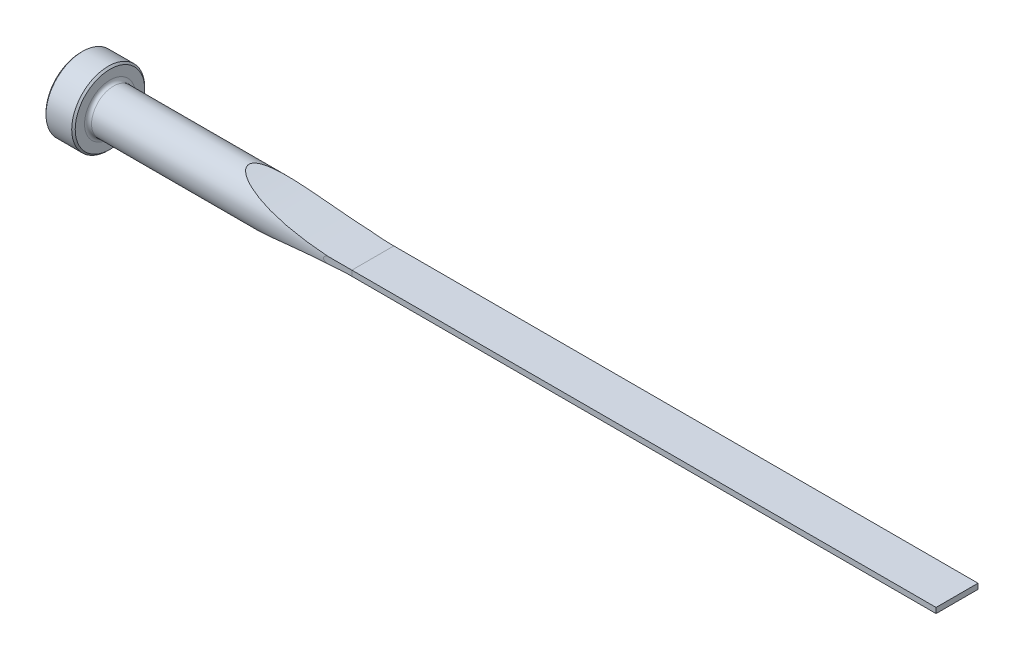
ISO-10303-21;
HEADER;
FILE_DESCRIPTION(('STEP AP214'),'2;1');
FILE_NAME('part.step','',(''),(''),'','','');
FILE_SCHEMA(('AUTOMOTIVE_DESIGN { 1 0 10303 214 1 1 1 1 }'));
ENDSEC;
DATA;
#1=APPLICATION_CONTEXT('core data for automotive mechanical design processes');
#2=APPLICATION_PROTOCOL_DEFINITION('international standard','automotive_design',2000,#1);
#3=PRODUCT_CONTEXT('',#1,'mechanical');
#4=PRODUCT('Part','Part','',(#3));
#5=PRODUCT_RELATED_PRODUCT_CATEGORY('part','',(#4));
#6=PRODUCT_DEFINITION_FORMATION('','',#4);
#7=PRODUCT_DEFINITION_CONTEXT('part definition',#1,'design');
#8=PRODUCT_DEFINITION('design','',#6,#7);
#9=PRODUCT_DEFINITION_SHAPE('','',#8);
#10=(LENGTH_UNIT() NAMED_UNIT(*) SI_UNIT(.MILLI.,.METRE.));
#11=(NAMED_UNIT(*) PLANE_ANGLE_UNIT() SI_UNIT($,.RADIAN.));
#12=(NAMED_UNIT(*) SI_UNIT($,.STERADIAN.) SOLID_ANGLE_UNIT());
#13=UNCERTAINTY_MEASURE_WITH_UNIT(LENGTH_MEASURE(1.E-05),#10,'distance_accuracy_value','');
#14=(GEOMETRIC_REPRESENTATION_CONTEXT(3) GLOBAL_UNCERTAINTY_ASSIGNED_CONTEXT((#13)) GLOBAL_UNIT_ASSIGNED_CONTEXT((#10,
#11,#12)) REPRESENTATION_CONTEXT('',''));
#15=CARTESIAN_POINT('',(0.,0.,0.));
#16=DIRECTION('',(0.,0.,1.));
#17=DIRECTION('',(1.,0.,0.));
#18=AXIS2_PLACEMENT_3D('',#15,#16,#17);
#19=CARTESIAN_POINT('',(0.,0.,0.));
#20=DIRECTION('',(-1.,0.,0.));
#21=DIRECTION('',(0.,0.,1.));
#22=AXIS2_PLACEMENT_3D('',#19,#20,#21);
#23=CYLINDRICAL_SURFACE('',#22,4.7625);
#24=CARTESIAN_POINT('',(7.112,0.,0.));
#25=DIRECTION('',(-1.,0.,0.));
#26=DIRECTION('',(0.,0.,1.));
#27=AXIS2_PLACEMENT_3D('',#24,#25,#26);
#28=CIRCLE('',#27,4.7625);
#29=CARTESIAN_POINT('',(7.112,0.,4.7625));
#30=VERTEX_POINT('',#29);
#31=EDGE_CURVE('E153',#30,#30,#28,.F.);
#32=ORIENTED_EDGE('',*,*,#31,.T.);
#33=EDGE_LOOP('',(#32));
#34=FACE_BOUND('',#33,.T.);
#35=CARTESIAN_POINT('',(63.5,1.37629566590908,4.55929999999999));
#36=CARTESIAN_POINT('',(63.300243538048,1.37627017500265,4.55929946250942));
#37=CARTESIAN_POINT('',(63.1004832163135,1.37406392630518,4.55997325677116));
#38=CARTESIAN_POINT('',(62.7010249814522,1.36511039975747,4.56266611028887));
#39=CARTESIAN_POINT('',(62.5013270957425,1.35836200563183,4.56468550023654));
#40=CARTESIAN_POINT('',(62.1003478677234,1.34006170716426,4.57009060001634));
#41=CARTESIAN_POINT('',(61.8990686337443,1.32846669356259,4.57348856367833));
#42=CARTESIAN_POINT('',(61.4969284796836,1.30007175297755,4.58164172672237));
#43=CARTESIAN_POINT('',(61.296067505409,1.28327254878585,4.58639673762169));
#44=CARTESIAN_POINT('',(60.8961767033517,1.2439534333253,4.59721659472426));
#45=CARTESIAN_POINT('',(60.6971431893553,1.22146913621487,4.6032732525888));
#46=CARTESIAN_POINT('',(60.2999040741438,1.16973426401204,4.61669265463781));
#47=CARTESIAN_POINT('',(60.1016988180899,1.14048110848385,4.62405589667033));
#48=CARTESIAN_POINT('',(59.7074850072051,1.07370926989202,4.64001372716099));
#49=CARTESIAN_POINT('',(59.5114710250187,1.03622172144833,4.64860363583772));
#50=CARTESIAN_POINT('',(59.1219644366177,0.950234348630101,4.66695416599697));
#51=CARTESIAN_POINT('',(58.9284697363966,0.901744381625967,4.67671373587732));
#52=CARTESIAN_POINT('',(58.689568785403,0.830609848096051,4.68952997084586));
#53=CARTESIAN_POINT('',(58.6417966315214,0.815810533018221,4.69213189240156));
#54=CARTESIAN_POINT('',(58.5466454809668,0.784967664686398,4.69739068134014));
#55=CARTESIAN_POINT('',(58.4992665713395,0.768923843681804,4.70004756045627));
#56=CARTESIAN_POINT('',(58.3571752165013,0.718404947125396,4.70812874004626));
#57=CARTESIAN_POINT('',(58.263234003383,0.681752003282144,4.71362458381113));
#58=CARTESIAN_POINT('',(58.0775344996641,0.599731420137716,4.72477713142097));
#59=CARTESIAN_POINT('',(57.9858203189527,0.554256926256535,4.73043499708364));
#60=CARTESIAN_POINT('',(57.8546141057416,0.476034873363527,4.73871868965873));
#61=CARTESIAN_POINT('',(57.8120990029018,0.448424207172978,4.7414354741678));
#62=CARTESIAN_POINT('',(57.7304247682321,0.388667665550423,4.74670987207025));
#63=CARTESIAN_POINT('',(57.6912549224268,0.356537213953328,4.74926798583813));
#64=CARTESIAN_POINT('',(57.6343845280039,0.30109449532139,4.75301502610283));
#65=CARTESIAN_POINT('',(57.6146643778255,0.279884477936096,4.75432176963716));
#66=CARTESIAN_POINT('',(57.578171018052,0.235020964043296,4.75675058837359));
#67=CARTESIAN_POINT('',(57.5613938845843,0.211370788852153,4.75787290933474));
#68=CARTESIAN_POINT('',(57.5361358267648,0.168085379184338,4.75956809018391));
#69=CARTESIAN_POINT('',(57.526635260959,0.149056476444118,4.76020769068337));
#70=CARTESIAN_POINT('',(57.51078402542,0.10971358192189,4.76127659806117));
#71=CARTESIAN_POINT('',(57.5044294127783,0.089401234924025,4.76170616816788));
#72=CARTESIAN_POINT('',(57.4955459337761,0.0476995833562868,4.76230708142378));
#73=CARTESIAN_POINT('',(57.4930580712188,0.0263011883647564,4.76247565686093));
#74=CARTESIAN_POINT('',(57.4924127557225,-0.0165581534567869,4.76251936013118));
#75=CARTESIAN_POINT('',(57.4942536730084,-0.0380190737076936,4.76239459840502));
#76=CARTESIAN_POINT('',(57.5014223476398,-0.0771509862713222,4.76190953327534));
#77=CARTESIAN_POINT('',(57.5062147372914,-0.0949256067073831,4.76158540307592));
#78=CARTESIAN_POINT('',(57.5183183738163,-0.129583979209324,4.76076832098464));
#79=CARTESIAN_POINT('',(57.5256312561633,-0.146467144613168,4.76027525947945));
#80=CARTESIAN_POINT('',(57.5478239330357,-0.190109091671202,4.75878258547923));
#81=CARTESIAN_POINT('',(57.564497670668,-0.215945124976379,4.75766444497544));
#82=CARTESIAN_POINT('',(57.6015159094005,-0.264813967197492,4.75519504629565));
#83=CARTESIAN_POINT('',(57.6218718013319,-0.28783769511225,4.75384306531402));
#84=CARTESIAN_POINT('',(57.6862463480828,-0.353109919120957,4.74959319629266));
#85=CARTESIAN_POINT('',(57.7337556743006,-0.391849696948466,4.74648889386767));
#86=CARTESIAN_POINT('',(57.8332528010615,-0.462955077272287,4.74007706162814));
#87=CARTESIAN_POINT('',(57.8852557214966,-0.495297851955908,4.73676885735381));
#88=CARTESIAN_POINT('',(58.0324605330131,-0.578484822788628,4.72754240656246));
#89=CARTESIAN_POINT('',(58.1303120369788,-0.624585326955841,4.72156110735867));
#90=CARTESIAN_POINT('',(58.3296567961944,-0.708279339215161,4.70972175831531));
#91=CARTESIAN_POINT('',(58.431158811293,-0.745850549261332,4.70386406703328));
#92=CARTESIAN_POINT('',(58.637175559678,-0.815246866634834,4.69233729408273));
#93=CARTESIAN_POINT('',(58.7417096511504,-0.84701459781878,4.68667050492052));
#94=CARTESIAN_POINT('',(58.9519315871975,-0.905852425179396,4.67565197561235));
#95=CARTESIAN_POINT('',(59.0576177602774,-0.932928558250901,4.67029983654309));
#96=CARTESIAN_POINT('',(59.3472077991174,-1.00180171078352,4.65615804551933));
#97=CARTESIAN_POINT('',(59.5319939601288,-1.03994988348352,4.64770520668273));
#98=CARTESIAN_POINT('',(59.9031150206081,-1.10820041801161,4.63190013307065));
#99=CARTESIAN_POINT('',(60.0894504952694,-1.13829964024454,4.62454832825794));
#100=CARTESIAN_POINT('',(60.4634968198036,-1.19209136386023,4.61097562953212));
#101=CARTESIAN_POINT('',(60.6512097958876,-1.21576959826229,4.60475726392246));
#102=CARTESIAN_POINT('',(61.0272867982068,-1.25764094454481,4.59349611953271));
#103=CARTESIAN_POINT('',(61.2156508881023,-1.2758335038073,4.58845345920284));
#104=CARTESIAN_POINT('',(61.7534776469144,-1.32086317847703,4.57577149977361));
#105=CARTESIAN_POINT('',(62.1034775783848,-1.34186157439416,4.56957976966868));
#106=CARTESIAN_POINT('',(62.628033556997,-1.36263417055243,4.56340533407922));
#107=CARTESIAN_POINT('',(62.8023917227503,-1.36777128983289,4.56186604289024));
#108=CARTESIAN_POINT('',(63.151163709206,-1.37459791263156,4.55981341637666));
#109=CARTESIAN_POINT('',(63.3255775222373,-1.37628777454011,4.55929997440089));
#110=CARTESIAN_POINT('',(63.4999999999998,-1.37629566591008,4.55929999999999));
#111=B_SPLINE_CURVE_WITH_KNOTS('',3,(#35,#36,#37,#38,#39,#40,#41,#42,#43,#44,#45,#46,#47,#48,
#49,#50,#51,#52,#53,#54,#55,#56,#57,#58,#59,#60,#61,#62,#63,#64,#65,#66,#67,#68,#69,#70,#71,#72,
#73,#74,#75,#76,#77,#78,#79,#80,#81,#82,#83,#84,#85,#86,#87,#88,#89,#90,#91,#92,#93,#94,#95,#96,
#97,#98,#99,#100,#101,#102,#103,#104,#105,#106,#107,#108,#109,#110),.UNSPECIFIED.,.F.,.F.,(4,2,
2,2,2,2,2,2,2,2,2,2,2,2,2,2,2,2,2,2,2,2,2,2,2,2,2,2,2,2,2,2,2,2,2,2,2,4),(0.,0.599262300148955,
1.19867192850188,1.80353056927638,2.40830524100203,3.00938132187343,3.6106869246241,
4.20975694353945,4.80829234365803,4.95851786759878,5.10877580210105,5.41155733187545,
5.71826557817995,5.87039269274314,6.0220127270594,6.10881533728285,6.19550132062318,
6.25911958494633,6.32265791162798,6.38686552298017,6.45104896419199,6.50606849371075,
6.56112379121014,6.65289509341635,6.74495530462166,6.92807013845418,7.11182707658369,
7.43597686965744,7.76096456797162,8.08900931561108,8.41662876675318,8.98296372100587,
9.54951926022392,10.1173235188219,10.6851849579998,11.7368092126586,12.2601040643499,
12.7833445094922),.UNSPECIFIED.);
#112=CARTESIAN_POINT('',(58.3937223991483,0.730969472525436,4.70606947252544));
#113=VERTEX_POINT('',#112);
#114=CARTESIAN_POINT('',(58.393722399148,-0.730969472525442,4.70606947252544));
#115=VERTEX_POINT('',#114);
#116=EDGE_CURVE('E156',#113,#115,#111,.T.);
#117=ORIENTED_EDGE('',*,*,#116,.F.);
#118=CARTESIAN_POINT('',(63.5,0.584199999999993,4.72653325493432));
#119=CARTESIAN_POINT('',(63.1029447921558,0.584199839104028,4.72652364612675));
#120=CARTESIAN_POINT('',(62.7058898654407,0.586860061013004,4.7262042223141));
#121=CARTESIAN_POINT('',(61.9118518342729,0.597500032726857,4.72487593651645));
#122=CARTESIAN_POINT('',(61.5148687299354,0.605479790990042,4.7238670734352));
#123=CARTESIAN_POINT('',(60.7210149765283,0.626758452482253,4.72108998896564));
#124=CARTESIAN_POINT('',(60.3241443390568,0.640057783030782,4.71932170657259));
#125=CARTESIAN_POINT('',(59.5306250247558,0.671972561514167,4.71488209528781));
#126=CARTESIAN_POINT('',(59.1339763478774,0.690588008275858,4.71221076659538));
#127=CARTESIAN_POINT('',(57.942109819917,0.754530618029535,4.70255315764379));
#128=CARTESIAN_POINT('',(57.1473181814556,0.807891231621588,4.69392942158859));
#129=CARTESIAN_POINT('',(55.5596004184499,0.935939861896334,4.67008030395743));
#130=CARTESIAN_POINT('',(54.7666742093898,1.01062689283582,4.65485522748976));
#131=CARTESIAN_POINT('',(53.1830270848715,1.1812867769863,4.61451041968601));
#132=CARTESIAN_POINT('',(52.3923071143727,1.27726765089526,4.58938695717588));
#133=CARTESIAN_POINT('',(51.2087661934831,1.4370868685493,4.5408421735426));
#134=CARTESIAN_POINT('',(50.814638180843,1.49300736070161,4.52284840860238));
#135=CARTESIAN_POINT('',(50.0273899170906,1.61010184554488,4.48250212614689));
#136=CARTESIAN_POINT('',(49.6342696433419,1.67127571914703,4.46014970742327));
#137=CARTESIAN_POINT('',(48.8495779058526,1.79877941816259,4.41026980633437));
#138=CARTESIAN_POINT('',(48.4580053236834,1.8651042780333,4.3827472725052));
#139=CARTESIAN_POINT('',(47.6762617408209,2.00290585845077,4.32151160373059));
#140=CARTESIAN_POINT('',(47.2860906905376,2.07438239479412,4.2877986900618));
#141=CARTESIAN_POINT('',(46.5075285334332,2.22239347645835,4.2129861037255));
#142=CARTESIAN_POINT('',(46.1191369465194,2.29892655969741,4.17188856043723));
#143=CARTESIAN_POINT('',(45.3444245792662,2.45695511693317,4.08082096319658));
#144=CARTESIAN_POINT('',(44.9581036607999,2.53845025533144,4.03085150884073));
#145=CARTESIAN_POINT('',(44.1874438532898,2.70637498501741,3.92008763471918));
#146=CARTESIAN_POINT('',(43.8031088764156,2.79281189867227,3.85927685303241));
#147=CARTESIAN_POINT('',(43.0377159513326,2.97027452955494,3.72442012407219));
#148=CARTESIAN_POINT('',(42.6566587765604,3.06130129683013,3.65037113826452));
#149=CARTESIAN_POINT('',(41.8987741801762,3.24761090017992,3.48568183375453));
#150=CARTESIAN_POINT('',(41.5219502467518,3.34289696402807,3.39502876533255));
#151=CARTESIAN_POINT('',(40.9618242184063,3.4883984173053,3.24304672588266));
#152=CARTESIAN_POINT('',(40.7760042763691,3.53731746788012,3.18973138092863));
#153=CARTESIAN_POINT('',(40.4064522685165,3.63587680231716,3.07691915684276));
#154=CARTESIAN_POINT('',(40.2227199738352,3.68551700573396,3.01742296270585));
#155=CARTESIAN_POINT('',(39.8569945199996,3.78557453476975,2.8909115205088));
#156=CARTESIAN_POINT('',(39.6750141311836,3.83599446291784,2.82386117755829));
#157=CARTESIAN_POINT('',(39.314453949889,3.93711113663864,2.68108699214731));
#158=CARTESIAN_POINT('',(39.1358753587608,3.98780797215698,2.60536014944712));
#159=CARTESIAN_POINT('',(38.7841209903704,4.08883317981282,2.44374796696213));
#160=CARTESIAN_POINT('',(38.6109269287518,4.13916221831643,2.35790320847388));
#161=CARTESIAN_POINT('',(38.2712961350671,4.23894369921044,2.17342840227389));
#162=CARTESIAN_POINT('',(38.104853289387,4.28839691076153,2.07481027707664));
#163=CARTESIAN_POINT('',(37.8275154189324,4.37163789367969,1.89136325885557));
#164=CARTESIAN_POINT('',(37.7141792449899,4.40591470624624,1.81047425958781));
#165=CARTESIAN_POINT('',(37.4946283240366,4.47276665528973,1.63838676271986));
#166=CARTESIAN_POINT('',(37.3884253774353,4.50533895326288,1.54717182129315));
#167=CARTESIAN_POINT('',(37.1857286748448,4.56788549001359,1.35148733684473));
#168=CARTESIAN_POINT('',(37.0893444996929,4.59782997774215,1.246892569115));
#169=CARTESIAN_POINT('',(36.9135348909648,4.65273004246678,1.02307765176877));
#170=CARTESIAN_POINT('',(36.8340566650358,4.67770113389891,0.903904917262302));
#171=CARTESIAN_POINT('',(36.7263611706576,4.71165622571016,0.698591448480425));
#172=CARTESIAN_POINT('',(36.6901398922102,4.72310998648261,0.617097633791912));
#173=CARTESIAN_POINT('',(36.6304074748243,4.74202643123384,0.449118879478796));
#174=CARTESIAN_POINT('',(36.6068809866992,4.74949393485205,0.362640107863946));
#175=CARTESIAN_POINT('',(36.5747493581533,4.75969832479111,0.185892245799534));
#176=CARTESIAN_POINT('',(36.5662630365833,4.7623975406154,0.0955986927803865));
#177=CARTESIAN_POINT('',(36.5656367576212,4.76259662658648,-0.0850575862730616));
#178=CARTESIAN_POINT('',(36.5734964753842,4.76009660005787,-0.175420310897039));
#179=CARTESIAN_POINT('',(36.6031382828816,4.75068226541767,-0.344936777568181));
#180=CARTESIAN_POINT('',(36.6235784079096,4.74419351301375,-0.424358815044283));
#181=CARTESIAN_POINT('',(36.6753356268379,4.72779541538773,-0.57916036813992));
#182=CARTESIAN_POINT('',(36.7066584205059,4.71788427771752,-0.654537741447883));
#183=CARTESIAN_POINT('',(36.7996380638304,4.68853838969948,-0.844402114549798));
#184=CARTESIAN_POINT('',(36.8682094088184,4.66696066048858,-0.955150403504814));
#185=CARTESIAN_POINT('',(37.0207367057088,4.61921883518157,-1.16440044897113));
#186=CARTESIAN_POINT('',(37.1047403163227,4.59304054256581,-1.26286263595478));
#187=CARTESIAN_POINT('',(37.2765502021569,4.53981707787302,-1.44205709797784));
#188=CARTESIAN_POINT('',(37.3636312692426,4.5129746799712,-1.52355894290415));
#189=CARTESIAN_POINT('',(37.544207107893,4.45764093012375,-1.6785779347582));
#190=CARTESIAN_POINT('',(37.6377077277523,4.42914807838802,-1.75208763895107));
#191=CARTESIAN_POINT('',(37.8295566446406,4.37104937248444,-1.89238074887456));
#192=CARTESIAN_POINT('',(37.9279143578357,4.34144138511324,-1.95915025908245));
#193=CARTESIAN_POINT('',(38.1281237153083,4.28156612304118,-2.08675712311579));
#194=CARTESIAN_POINT('',(38.2299740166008,4.2512991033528,-2.14759672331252));
#195=CARTESIAN_POINT('',(38.4910069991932,4.17425155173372,-2.29503203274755));
#196=CARTESIAN_POINT('',(38.6520244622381,4.1272029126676,-2.37823331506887));
#197=CARTESIAN_POINT('',(38.9786309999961,4.03280203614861,-2.53500840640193));
#198=CARTESIAN_POINT('',(39.1442223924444,3.98544965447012,-2.60857722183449));
#199=CARTESIAN_POINT('',(39.4790520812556,3.89077510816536,-2.74779361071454));
#200=CARTESIAN_POINT('',(39.6482962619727,3.8434531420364,-2.81342707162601));
#201=CARTESIAN_POINT('',(39.9893834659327,3.74918830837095,-2.93787024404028));
#202=CARTESIAN_POINT('',(40.1612267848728,3.70224548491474,-2.99667917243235));
#203=CARTESIAN_POINT('',(40.5078505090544,3.60868860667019,-3.10871744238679));
#204=CARTESIAN_POINT('',(40.6826415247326,3.56207751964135,-3.1619162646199));
#205=CARTESIAN_POINT('',(41.0338956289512,3.4695666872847,-3.263159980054));
#206=CARTESIAN_POINT('',(41.2103587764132,3.42366696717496,-3.31120469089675));
#207=CARTESIAN_POINT('',(41.5644516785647,3.33273400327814,-3.40271152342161));
#208=CARTESIAN_POINT('',(41.7420798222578,3.28769980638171,-3.44617895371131));
#209=CARTESIAN_POINT('',(42.0984831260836,3.19851852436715,-3.52910575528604));
#210=CARTESIAN_POINT('',(42.2772582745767,3.15437143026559,-3.56856516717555));
#211=CARTESIAN_POINT('',(42.7883189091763,3.02986034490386,-3.67597342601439));
#212=CARTESIAN_POINT('',(43.1217965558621,2.95064094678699,-3.73959639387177));
#213=CARTESIAN_POINT('',(43.7913367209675,2.79569603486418,-3.85679987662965));
#214=CARTESIAN_POINT('',(44.1273995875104,2.71997100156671,-3.91037901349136));
#215=CARTESIAN_POINT('',(44.8017052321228,2.57215848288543,-4.00915320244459));
#216=CARTESIAN_POINT('',(45.139948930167,2.50007266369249,-4.05434443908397));
#217=CARTESIAN_POINT('',(45.8181027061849,2.3596889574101,-4.13762369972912));
#218=CARTESIAN_POINT('',(46.1580128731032,2.29139127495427,-4.17571134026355));
#219=CARTESIAN_POINT('',(46.8399513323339,2.15852385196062,-4.24592035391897));
#220=CARTESIAN_POINT('',(47.1819826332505,2.09396260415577,-4.27802847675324));
#221=CARTESIAN_POINT('',(47.8672169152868,1.96878754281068,-4.3370563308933));
#222=CARTESIAN_POINT('',(48.2104199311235,1.90817384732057,-4.36397590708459));
#223=CARTESIAN_POINT('',(49.2413340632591,1.73235474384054,-4.43808621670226));
#224=CARTESIAN_POINT('',(49.9305531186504,1.62313178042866,-4.47864845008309));
#225=CARTESIAN_POINT('',(51.3117624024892,1.42090467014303,-4.54684140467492));
#226=CARTESIAN_POINT('',(52.0037518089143,1.32789603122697,-4.57447571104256));
#227=CARTESIAN_POINT('',(53.3900734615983,1.1581728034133,-4.62036451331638));
#228=CARTESIAN_POINT('',(54.0844058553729,1.08145926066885,-4.63861840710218));
#229=CARTESIAN_POINT('',(55.4740341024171,0.944486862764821,-4.66843092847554));
#230=CARTESIAN_POINT('',(56.1693279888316,0.884209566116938,-4.67999707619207));
#231=CARTESIAN_POINT('',(57.5611660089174,0.780044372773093,-4.69848274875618));
#232=CARTESIAN_POINT('',(58.2577100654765,0.736155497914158,-4.70540255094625));
#233=CARTESIAN_POINT('',(59.33356868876,0.681076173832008,-4.71358774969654));
#234=CARTESIAN_POINT('',(59.7125884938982,0.664103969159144,-4.71599244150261));
#235=CARTESIAN_POINT('',(60.4708519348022,0.63501192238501,-4.71999838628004));
#236=CARTESIAN_POINT('',(60.8500955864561,0.622892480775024,-4.72159957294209));
#237=CARTESIAN_POINT('',(61.6077672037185,0.603534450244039,-4.72411384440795));
#238=CARTESIAN_POINT('',(61.9861948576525,0.596283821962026,-4.72502862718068));
#239=CARTESIAN_POINT('',(62.7430816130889,0.586616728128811,-4.72623431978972));
#240=CARTESIAN_POINT('',(63.1215407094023,0.584199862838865,-4.72652528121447));
#241=CARTESIAN_POINT('',(63.5,0.584199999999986,-4.72653325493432));
#242=B_SPLINE_CURVE_WITH_KNOTS('',3,(#118,#119,#120,#121,#122,#123,#124,#125,#126,#127,#128,
#129,#130,#131,#132,#133,#134,#135,#136,#137,#138,#139,#140,#141,#142,#143,#144,#145,#146,#147,
#148,#149,#150,#151,#152,#153,#154,#155,#156,#157,#158,#159,#160,#161,#162,#163,#164,#165,#166,
#167,#168,#169,#170,#171,#172,#173,#174,#175,#176,#177,#178,#179,#180,#181,#182,#183,#184,#185,
#186,#187,#188,#189,#190,#191,#192,#193,#194,#195,#196,#197,#198,#199,#200,#201,#202,#203,#204,
#205,#206,#207,#208,#209,#210,#211,#212,#213,#214,#215,#216,#217,#218,#219,#220,#221,#222,#223,
#224,#225,#226,#227,#228,#229,#230,#231,#232,#233,#234,#235,#236,#237,#238,#239,#240,#241),
.UNSPECIFIED.,.F.,.F.,(4,2,2,2,2,2,2,2,2,2,2,2,2,2,2,2,2,2,2,2,2,2,2,2,2,2,2,2,2,2,2,2,2,2,2,2,
2,2,2,2,2,2,2,2,2,2,2,2,2,2,2,2,2,2,2,2,2,2,2,2,2,4),(0.,1.1911559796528,2.38231385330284,
3.5735674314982,4.76482074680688,7.15436772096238,9.54380426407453,11.9341423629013,
13.129539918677,14.3249103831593,15.5191424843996,16.7133319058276,17.907177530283,
19.1009425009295,20.2965246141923,21.4923814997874,22.6891605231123,23.2873079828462,
23.8853892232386,24.4863734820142,25.0875661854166,25.686424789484,26.2847284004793,
26.714511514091,27.1449889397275,27.5798390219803,28.013310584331,28.2821342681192,
28.5506321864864,28.8212419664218,29.0918463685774,29.3376505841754,29.5835837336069,
29.9774048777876,30.3724633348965,30.738683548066,31.1052419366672,31.4725412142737,
31.8397008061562,32.4010306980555,32.9626504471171,33.5252547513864,34.0879235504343,
34.6535105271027,35.2191175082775,35.7840611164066,36.3489990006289,37.3946090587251,
38.4403624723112,39.4865904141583,40.5328748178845,41.5814508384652,42.6300582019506,
44.7266503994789,46.8226608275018,48.918805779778,51.012589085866,53.1062474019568,
54.2444421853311,55.3827308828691,56.5181944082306,57.6535640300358),.UNSPECIFIED.);
#243=CARTESIAN_POINT('',(58.3937223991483,0.730969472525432,-4.70606947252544));
#244=VERTEX_POINT('',#243);
#245=EDGE_CURVE('E106',#113,#244,#242,.T.);
#246=ORIENTED_EDGE('',*,*,#245,.T.);
#247=CARTESIAN_POINT('',(63.5,1.37629566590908,-4.55929999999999));
#248=CARTESIAN_POINT('',(63.3002435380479,1.37627017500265,-4.55929946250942));
#249=CARTESIAN_POINT('',(63.1004832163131,1.37406392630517,-4.55997325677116));
#250=CARTESIAN_POINT('',(62.7010249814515,1.36511039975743,-4.56266611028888));
#251=CARTESIAN_POINT('',(62.5013270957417,1.35836200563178,-4.56468550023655));
#252=CARTESIAN_POINT('',(62.1003478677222,1.34006170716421,-4.57009060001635));
#253=CARTESIAN_POINT('',(61.899068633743,1.32846669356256,-4.57348856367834));
#254=CARTESIAN_POINT('',(61.496928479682,1.30007175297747,-4.58164172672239));
#255=CARTESIAN_POINT('',(61.2960675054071,1.28327254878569,-4.58639673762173));
#256=CARTESIAN_POINT('',(60.8961767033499,1.2439534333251,-4.59721659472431));
#257=CARTESIAN_POINT('',(60.6971431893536,1.22146913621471,-4.60327325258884));
#258=CARTESIAN_POINT('',(60.2999040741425,1.16973426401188,-4.61669265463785));
#259=CARTESIAN_POINT('',(60.1016988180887,1.14048110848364,-4.62405589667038));
#260=CARTESIAN_POINT('',(59.7074850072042,1.07370926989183,-4.64001372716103));
#261=CARTESIAN_POINT('',(59.5114710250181,1.03622172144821,-4.64860363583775));
#262=CARTESIAN_POINT('',(59.1219644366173,0.950234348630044,-4.66695416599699));
#263=CARTESIAN_POINT('',(58.9284697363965,0.901744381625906,-4.67671373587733));
#264=CARTESIAN_POINT('',(58.689568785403,0.830609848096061,-4.68952997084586));
#265=CARTESIAN_POINT('',(58.6417966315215,0.815810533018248,-4.69213189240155));
#266=CARTESIAN_POINT('',(58.546645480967,0.784967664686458,-4.69739068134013));
#267=CARTESIAN_POINT('',(58.4992665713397,0.76892384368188,-4.70004756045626));
#268=CARTESIAN_POINT('',(58.3571752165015,0.718404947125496,-4.70812874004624));
#269=CARTESIAN_POINT('',(58.2632340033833,0.681752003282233,-4.71362458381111));
#270=CARTESIAN_POINT('',(58.0775344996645,0.599731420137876,-4.72477713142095));
#271=CARTESIAN_POINT('',(57.9858203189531,0.554256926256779,-4.73043499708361));
#272=CARTESIAN_POINT('',(57.8546141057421,0.476034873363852,-4.7387186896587));
#273=CARTESIAN_POINT('',(57.8120990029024,0.448424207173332,-4.74143547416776));
#274=CARTESIAN_POINT('',(57.7304247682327,0.388667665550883,-4.74670987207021));
#275=CARTESIAN_POINT('',(57.6912549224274,0.356537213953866,-4.74926798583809));
#276=CARTESIAN_POINT('',(57.6343845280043,0.301094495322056,-4.75301502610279));
#277=CARTESIAN_POINT('',(57.6146643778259,0.279884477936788,-4.75432176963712));
#278=CARTESIAN_POINT('',(57.5781710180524,0.235020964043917,-4.75675058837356));
#279=CARTESIAN_POINT('',(57.5613938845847,0.211370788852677,-4.75787290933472));
#280=CARTESIAN_POINT('',(57.5361358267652,0.168085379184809,-4.7595680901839));
#281=CARTESIAN_POINT('',(57.5266352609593,0.149056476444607,-4.76020769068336));
#282=CARTESIAN_POINT('',(57.5107840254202,0.109713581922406,-4.76127659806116));
#283=CARTESIAN_POINT('',(57.5044294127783,0.0894012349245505,-4.76170616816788));
#284=CARTESIAN_POINT('',(57.495545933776,0.0476995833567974,-4.76230708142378));
#285=CARTESIAN_POINT('',(57.4930580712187,0.026301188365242,-4.76247565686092));
#286=CARTESIAN_POINT('',(57.4924127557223,-0.0165581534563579,-4.76251936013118));
#287=CARTESIAN_POINT('',(57.4942536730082,-0.0380190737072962,-4.76239459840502));
#288=CARTESIAN_POINT('',(57.5014223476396,-0.0771509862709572,-4.76190953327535));
#289=CARTESIAN_POINT('',(57.5062147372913,-0.0949256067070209,-4.76158540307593));
#290=CARTESIAN_POINT('',(57.5183183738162,-0.129583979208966,-4.76076832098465));
#291=CARTESIAN_POINT('',(57.5256312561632,-0.146467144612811,-4.76027525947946));
#292=CARTESIAN_POINT('',(57.5478239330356,-0.190109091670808,-4.75878258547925));
#293=CARTESIAN_POINT('',(57.5644976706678,-0.215945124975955,-4.75766444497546));
#294=CARTESIAN_POINT('',(57.6015159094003,-0.264813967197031,-4.75519504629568));
#295=CARTESIAN_POINT('',(57.6218718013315,-0.287837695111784,-4.75384306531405));
#296=CARTESIAN_POINT('',(57.6862463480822,-0.353109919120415,-4.7495931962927));
#297=CARTESIAN_POINT('',(57.7337556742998,-0.391849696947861,-4.74648889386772));
#298=CARTESIAN_POINT('',(57.8332528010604,-0.462955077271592,-4.7400770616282));
#299=CARTESIAN_POINT('',(57.8852557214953,-0.495297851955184,-4.73676885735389));
#300=CARTESIAN_POINT('',(58.0324605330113,-0.578484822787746,-4.72754240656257));
#301=CARTESIAN_POINT('',(58.1303120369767,-0.624585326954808,-4.72156110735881));
#302=CARTESIAN_POINT('',(58.3296567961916,-0.708279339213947,-4.70972175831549));
#303=CARTESIAN_POINT('',(58.4311588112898,-0.74585054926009,-4.70386406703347));
#304=CARTESIAN_POINT('',(58.6371755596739,-0.815246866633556,-4.69233729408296));
#305=CARTESIAN_POINT('',(58.741709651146,-0.847014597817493,-4.68667050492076));
#306=CARTESIAN_POINT('',(58.9519315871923,-0.905852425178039,-4.67565197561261));
#307=CARTESIAN_POINT('',(59.0576177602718,-0.932928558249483,-4.67029983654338));
#308=CARTESIAN_POINT('',(59.3472077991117,-1.00180171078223,-4.65615804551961));
#309=CARTESIAN_POINT('',(59.5319939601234,-1.03994988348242,-4.64770520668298));
#310=CARTESIAN_POINT('',(59.9031150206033,-1.10820041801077,-4.63190013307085));
#311=CARTESIAN_POINT('',(60.0894504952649,-1.13829964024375,-4.62454832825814));
#312=CARTESIAN_POINT('',(60.4634968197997,-1.19209136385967,-4.61097562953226));
#313=CARTESIAN_POINT('',(60.651209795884,-1.21576959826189,-4.60475726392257));
#314=CARTESIAN_POINT('',(61.0272867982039,-1.25764094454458,-4.59349611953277));
#315=CARTESIAN_POINT('',(61.2156508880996,-1.27583350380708,-4.5884534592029));
#316=CARTESIAN_POINT('',(61.7534776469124,-1.32086317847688,-4.57577149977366));
#317=CARTESIAN_POINT('',(62.1034775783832,-1.34186157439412,-4.56957976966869));
#318=CARTESIAN_POINT('',(62.6280335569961,-1.36263417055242,-4.56340533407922));
#319=CARTESIAN_POINT('',(62.8023917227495,-1.36777128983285,-4.56186604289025));
#320=CARTESIAN_POINT('',(63.1511637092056,-1.37459791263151,-4.55981341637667));
#321=CARTESIAN_POINT('',(63.3255775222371,-1.37628777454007,-4.5592999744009));
#322=CARTESIAN_POINT('',(63.4999999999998,-1.37629566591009,-4.55929999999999));
#323=B_SPLINE_CURVE_WITH_KNOTS('',3,(#247,#248,#249,#250,#251,#252,#253,#254,#255,#256,#257,
#258,#259,#260,#261,#262,#263,#264,#265,#266,#267,#268,#269,#270,#271,#272,#273,#274,#275,#276,
#277,#278,#279,#280,#281,#282,#283,#284,#285,#286,#287,#288,#289,#290,#291,#292,#293,#294,#295,
#296,#297,#298,#299,#300,#301,#302,#303,#304,#305,#306,#307,#308,#309,#310,#311,#312,#313,#314,
#315,#316,#317,#318,#319,#320,#321,#322),.UNSPECIFIED.,.F.,.F.,(4,2,2,2,2,2,2,2,2,2,2,2,2,2,2,2,
2,2,2,2,2,2,2,2,2,2,2,2,2,2,2,2,2,2,2,2,2,4),(0.,0.599262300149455,1.19867192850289,
1.80353056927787,2.40830524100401,3.00938132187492,3.61068692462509,4.20975694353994,
4.80829234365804,4.95851786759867,5.10877580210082,5.41155733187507,5.71826557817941,
5.87039269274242,6.02201272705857,6.10881533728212,6.19550132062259,6.25911958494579,
6.32265791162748,6.38686552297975,6.45104896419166,6.50606849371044,6.56112379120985,
6.65289509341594,6.7449553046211,6.92807013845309,7.11182707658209,7.43597686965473,
7.7609645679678,8.08900931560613,8.4166287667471,8.98296372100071,9.54951926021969,
10.1173235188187,10.6851849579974,11.7368092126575,12.2601040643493,12.7833445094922),.UNSPECIFIED.);
#324=CARTESIAN_POINT('',(58.393722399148,-0.730969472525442,-4.70606947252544));
#325=VERTEX_POINT('',#324);
#326=EDGE_CURVE('E175',#244,#325,#323,.T.);
#327=ORIENTED_EDGE('',*,*,#326,.T.);
#328=CARTESIAN_POINT('',(63.5,-0.584199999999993,4.72653325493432));
#329=CARTESIAN_POINT('',(63.1029447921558,-0.584199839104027,4.72652364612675));
#330=CARTESIAN_POINT('',(62.7058898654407,-0.586860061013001,4.7262042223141));
#331=CARTESIAN_POINT('',(61.9118518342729,-0.597500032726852,4.72487593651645));
#332=CARTESIAN_POINT('',(61.5148687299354,-0.605479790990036,4.7238670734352));
#333=CARTESIAN_POINT('',(60.7210149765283,-0.626758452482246,4.72108998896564));
#334=CARTESIAN_POINT('',(60.3241443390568,-0.640057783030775,4.71932170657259));
#335=CARTESIAN_POINT('',(59.5306250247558,-0.671972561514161,4.71488209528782));
#336=CARTESIAN_POINT('',(59.1339763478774,-0.690588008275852,4.71221076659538));
#337=CARTESIAN_POINT('',(57.942109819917,-0.754530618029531,4.70255315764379));
#338=CARTESIAN_POINT('',(57.1473181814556,-0.807891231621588,4.69392942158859));
#339=CARTESIAN_POINT('',(55.5596004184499,-0.935939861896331,4.67008030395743));
#340=CARTESIAN_POINT('',(54.7666742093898,-1.01062689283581,4.65485522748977));
#341=CARTESIAN_POINT('',(53.1830270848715,-1.18128677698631,4.61451041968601));
#342=CARTESIAN_POINT('',(52.3923071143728,-1.27726765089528,4.58938695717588));
#343=CARTESIAN_POINT('',(51.2087661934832,-1.4370868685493,4.5408421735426));
#344=CARTESIAN_POINT('',(50.814638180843,-1.4930073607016,4.52284840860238));
#345=CARTESIAN_POINT('',(50.0273899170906,-1.61010184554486,4.4825021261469));
#346=CARTESIAN_POINT('',(49.6342696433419,-1.67127571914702,4.46014970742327));
#347=CARTESIAN_POINT('',(48.8495779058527,-1.79877941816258,4.41026980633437));
#348=CARTESIAN_POINT('',(48.4580053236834,-1.86510427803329,4.3827472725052));
#349=CARTESIAN_POINT('',(47.6762617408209,-2.00290585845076,4.3215116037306));
#350=CARTESIAN_POINT('',(47.2860906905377,-2.07438239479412,4.2877986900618));
#351=CARTESIAN_POINT('',(46.5075285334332,-2.22239347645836,4.2129861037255));
#352=CARTESIAN_POINT('',(46.1191369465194,-2.29892655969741,4.17188856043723));
#353=CARTESIAN_POINT('',(45.3444245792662,-2.45695511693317,4.08082096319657));
#354=CARTESIAN_POINT('',(44.9581036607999,-2.53845025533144,4.03085150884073));
#355=CARTESIAN_POINT('',(44.1874438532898,-2.7063749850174,3.92008763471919));
#356=CARTESIAN_POINT('',(43.8031088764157,-2.79281189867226,3.85927685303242));
#357=CARTESIAN_POINT('',(43.0377159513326,-2.97027452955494,3.7244201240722));
#358=CARTESIAN_POINT('',(42.6566587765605,-3.06130129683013,3.65037113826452));
#359=CARTESIAN_POINT('',(41.8987741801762,-3.24761090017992,3.48568183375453));
#360=CARTESIAN_POINT('',(41.5219502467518,-3.34289696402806,3.39502876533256));
#361=CARTESIAN_POINT('',(40.9618242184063,-3.4883984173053,3.24304672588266));
#362=CARTESIAN_POINT('',(40.7760042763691,-3.53731746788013,3.18973138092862));
#363=CARTESIAN_POINT('',(40.4064522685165,-3.63587680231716,3.07691915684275));
#364=CARTESIAN_POINT('',(40.2227199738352,-3.68551700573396,3.01742296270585));
#365=CARTESIAN_POINT('',(39.8569945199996,-3.78557453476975,2.8909115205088));
#366=CARTESIAN_POINT('',(39.6750141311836,-3.83599446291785,2.82386117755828));
#367=CARTESIAN_POINT('',(39.3144539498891,-3.93711113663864,2.6810869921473));
#368=CARTESIAN_POINT('',(39.1358753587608,-3.98780797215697,2.60536014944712));
#369=CARTESIAN_POINT('',(38.7841209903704,-4.08883317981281,2.44374796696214));
#370=CARTESIAN_POINT('',(38.6109269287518,-4.13916221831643,2.35790320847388));
#371=CARTESIAN_POINT('',(38.2712961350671,-4.23894369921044,2.17342840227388));
#372=CARTESIAN_POINT('',(38.104853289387,-4.28839691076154,2.07481027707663));
#373=CARTESIAN_POINT('',(37.8275154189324,-4.3716378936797,1.89136325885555));
#374=CARTESIAN_POINT('',(37.7141792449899,-4.40591470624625,1.81047425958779));
#375=CARTESIAN_POINT('',(37.4946283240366,-4.47276665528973,1.63838676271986));
#376=CARTESIAN_POINT('',(37.3884253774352,-4.50533895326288,1.54717182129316));
#377=CARTESIAN_POINT('',(37.1857286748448,-4.56788549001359,1.35148733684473));
#378=CARTESIAN_POINT('',(37.0893444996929,-4.59782997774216,1.24689256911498));
#379=CARTESIAN_POINT('',(36.9135348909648,-4.65273004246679,1.02307765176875));
#380=CARTESIAN_POINT('',(36.8340566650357,-4.67770113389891,0.903904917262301));
#381=CARTESIAN_POINT('',(36.7263611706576,-4.71165622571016,0.698591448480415));
#382=CARTESIAN_POINT('',(36.6901398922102,-4.72310998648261,0.61709763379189));
#383=CARTESIAN_POINT('',(36.6304074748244,-4.74202643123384,0.449118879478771));
#384=CARTESIAN_POINT('',(36.6068809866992,-4.74949393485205,0.36264010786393));
#385=CARTESIAN_POINT('',(36.5747493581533,-4.75969832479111,0.185892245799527));
#386=CARTESIAN_POINT('',(36.5662630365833,-4.7623975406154,0.0955986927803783));
#387=CARTESIAN_POINT('',(36.5656367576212,-4.76259662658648,-0.0850575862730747));
#388=CARTESIAN_POINT('',(36.5734964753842,-4.76009660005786,-0.175420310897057));
#389=CARTESIAN_POINT('',(36.6031382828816,-4.75068226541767,-0.344936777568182));
#390=CARTESIAN_POINT('',(36.6235784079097,-4.74419351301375,-0.424358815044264));
#391=CARTESIAN_POINT('',(36.675335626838,-4.72779541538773,-0.579160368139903));
#392=CARTESIAN_POINT('',(36.7066584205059,-4.71788427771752,-0.654537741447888));
#393=CARTESIAN_POINT('',(36.7996380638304,-4.68853838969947,-0.844402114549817));
#394=CARTESIAN_POINT('',(36.8682094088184,-4.66696066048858,-0.955150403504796));
#395=CARTESIAN_POINT('',(37.0207367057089,-4.61921883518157,-1.1644004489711));
#396=CARTESIAN_POINT('',(37.1047403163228,-4.5930405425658,-1.26286263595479));
#397=CARTESIAN_POINT('',(37.2765502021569,-4.53981707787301,-1.44205709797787));
#398=CARTESIAN_POINT('',(37.3636312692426,-4.51297467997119,-1.5235589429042));
#399=CARTESIAN_POINT('',(37.544207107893,-4.45764093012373,-1.67857793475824));
#400=CARTESIAN_POINT('',(37.6377077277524,-4.42914807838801,-1.7520876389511));
#401=CARTESIAN_POINT('',(37.8295566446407,-4.37104937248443,-1.8923807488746));
#402=CARTESIAN_POINT('',(37.9279143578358,-4.34144138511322,-1.9591502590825));
#403=CARTESIAN_POINT('',(38.1281237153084,-4.28156612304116,-2.08675712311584));
#404=CARTESIAN_POINT('',(38.2299740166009,-4.25129910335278,-2.14759672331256));
#405=CARTESIAN_POINT('',(38.4910069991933,-4.1742515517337,-2.29503203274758));
#406=CARTESIAN_POINT('',(38.6520244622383,-4.12720291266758,-2.3782333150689));
#407=CARTESIAN_POINT('',(38.9786309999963,-4.03280203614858,-2.53500840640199));
#408=CARTESIAN_POINT('',(39.1442223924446,-3.98544965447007,-2.60857722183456));
#409=CARTESIAN_POINT('',(39.4790520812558,-3.89077510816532,-2.74779361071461));
#410=CARTESIAN_POINT('',(39.6482962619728,-3.84345314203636,-2.81342707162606));
#411=CARTESIAN_POINT('',(39.9893834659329,-3.74918830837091,-2.93787024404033));
#412=CARTESIAN_POINT('',(40.161226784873,-3.70224548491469,-2.99667917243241));
#413=CARTESIAN_POINT('',(40.5078505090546,-3.60868860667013,-3.10871744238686));
#414=CARTESIAN_POINT('',(40.6826415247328,-3.56207751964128,-3.16191626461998));
#415=CARTESIAN_POINT('',(41.0338956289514,-3.46956668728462,-3.26315998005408));
#416=CARTESIAN_POINT('',(41.2103587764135,-3.42366696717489,-3.31120469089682));
#417=CARTESIAN_POINT('',(41.564451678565,-3.33273400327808,-3.40271152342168));
#418=CARTESIAN_POINT('',(41.742079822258,-3.28769980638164,-3.44617895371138));
#419=CARTESIAN_POINT('',(42.0984831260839,-3.19851852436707,-3.52910575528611));
#420=CARTESIAN_POINT('',(42.277258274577,-3.15437143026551,-3.56856516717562));
#421=CARTESIAN_POINT('',(42.7883189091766,-3.02986034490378,-3.67597342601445));
#422=CARTESIAN_POINT('',(43.1217965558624,-2.95064094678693,-3.73959639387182));
#423=CARTESIAN_POINT('',(43.7913367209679,-2.7956960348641,-3.85679987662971));
#424=CARTESIAN_POINT('',(44.1273995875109,-2.7199710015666,-3.91037901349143));
#425=CARTESIAN_POINT('',(44.8017052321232,-2.5721584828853,-4.00915320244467));
#426=CARTESIAN_POINT('',(45.1399489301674,-2.50007266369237,-4.05434443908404));
#427=CARTESIAN_POINT('',(45.8181027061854,-2.35968895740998,-4.13762369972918));
#428=CARTESIAN_POINT('',(46.1580128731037,-2.29139127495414,-4.17571134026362));
#429=CARTESIAN_POINT('',(46.8399513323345,-2.15852385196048,-4.24592035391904));
#430=CARTESIAN_POINT('',(47.1819826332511,-2.09396260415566,-4.2780284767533));
#431=CARTESIAN_POINT('',(47.8672169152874,-1.96878754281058,-4.33705633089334));
#432=CARTESIAN_POINT('',(48.2104199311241,-1.90817384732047,-4.36397590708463));
#433=CARTESIAN_POINT('',(49.2413340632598,-1.73235474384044,-4.4380862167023));
#434=CARTESIAN_POINT('',(49.9305531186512,-1.62313178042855,-4.47864845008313));
#435=CARTESIAN_POINT('',(51.31176240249,-1.42090467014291,-4.54684140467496));
#436=CARTESIAN_POINT('',(52.0037518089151,-1.32789603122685,-4.57447571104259));
#437=CARTESIAN_POINT('',(53.3900734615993,-1.15817280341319,-4.6203645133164));
#438=CARTESIAN_POINT('',(54.0844058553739,-1.08145926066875,-4.6386184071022));
#439=CARTESIAN_POINT('',(55.4740341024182,-0.944486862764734,-4.66843092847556));
#440=CARTESIAN_POINT('',(56.1693279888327,-0.884209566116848,-4.67999707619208));
#441=CARTESIAN_POINT('',(57.5611660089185,-0.780044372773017,-4.69848274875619));
#442=CARTESIAN_POINT('',(58.2577100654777,-0.736155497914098,-4.70540255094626));
#443=CARTESIAN_POINT('',(59.3335686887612,-0.681076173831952,-4.71358774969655));
#444=CARTESIAN_POINT('',(59.7125884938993,-0.664103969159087,-4.71599244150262));
#445=CARTESIAN_POINT('',(60.470851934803,-0.635011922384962,-4.71999838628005));
#446=CARTESIAN_POINT('',(60.8500955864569,-0.622892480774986,-4.72159957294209));
#447=CARTESIAN_POINT('',(61.607767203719,-0.60353445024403,-4.72411384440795));
#448=CARTESIAN_POINT('',(61.986194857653,-0.596283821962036,-4.72502862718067));
#449=CARTESIAN_POINT('',(62.7430816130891,-0.586616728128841,-4.72623431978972));
#450=CARTESIAN_POINT('',(63.1215407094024,-0.584199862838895,-4.72652528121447));
#451=CARTESIAN_POINT('',(63.5,-0.584199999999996,-4.72653325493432));
#452=B_SPLINE_CURVE_WITH_KNOTS('',3,(#328,#329,#330,#331,#332,#333,#334,#335,#336,#337,#338,
#339,#340,#341,#342,#343,#344,#345,#346,#347,#348,#349,#350,#351,#352,#353,#354,#355,#356,#357,
#358,#359,#360,#361,#362,#363,#364,#365,#366,#367,#368,#369,#370,#371,#372,#373,#374,#375,#376,
#377,#378,#379,#380,#381,#382,#383,#384,#385,#386,#387,#388,#389,#390,#391,#392,#393,#394,#395,
#396,#397,#398,#399,#400,#401,#402,#403,#404,#405,#406,#407,#408,#409,#410,#411,#412,#413,#414,
#415,#416,#417,#418,#419,#420,#421,#422,#423,#424,#425,#426,#427,#428,#429,#430,#431,#432,#433,
#434,#435,#436,#437,#438,#439,#440,#441,#442,#443,#444,#445,#446,#447,#448,#449,#450,#451),
.UNSPECIFIED.,.F.,.F.,(4,2,2,2,2,2,2,2,2,2,2,2,2,2,2,2,2,2,2,2,2,2,2,2,2,2,2,2,2,2,2,2,2,2,2,2,
2,2,2,2,2,2,2,2,2,2,2,2,2,2,2,2,2,2,2,2,2,2,2,2,2,4),(0.,1.1911559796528,2.38231385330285,
3.57356743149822,4.76482074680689,7.15436772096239,9.54380426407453,11.9341423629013,
13.129539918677,14.3249103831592,15.5191424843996,16.7133319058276,17.907177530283,
19.1009425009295,20.2965246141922,21.4923814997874,22.6891605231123,23.2873079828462,
23.8853892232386,24.4863734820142,25.0875661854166,25.686424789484,26.2847284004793,
26.714511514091,27.1449889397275,27.5798390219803,28.013310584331,28.2821342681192,
28.5506321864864,28.8212419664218,29.0918463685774,29.3376505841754,29.583583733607,
29.9774048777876,30.3724633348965,30.738683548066,31.1052419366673,31.4725412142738,
31.8397008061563,32.4010306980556,32.9626504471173,33.5252547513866,34.0879235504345,
34.6535105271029,35.2191175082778,35.7840611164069,36.3489990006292,37.3946090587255,
38.4403624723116,39.4865904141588,40.532874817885,41.5814508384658,42.6300582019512,
44.7266503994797,46.8226608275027,48.918805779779,51.0125890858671,53.1062474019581,
54.2444421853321,55.3827308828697,56.5181944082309,57.6535640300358),.UNSPECIFIED.);
#453=EDGE_CURVE('E105',#115,#325,#452,.T.);
#454=ORIENTED_EDGE('',*,*,#453,.F.);
#455=EDGE_LOOP('',(#117,#246,#327,#454));
#456=FACE_BOUND('',#455,.T.);
#457=ADVANCED_FACE('F33',(#34,#456),#23,.T.);
#458=CARTESIAN_POINT('',(190.5,4.7625,0.));
#459=DIRECTION('',(-1.,0.,0.));
#460=DIRECTION('',(0.,0.,1.));
#461=AXIS2_PLACEMENT_3D('',#458,#459,#460);
#462=PLANE('',#461);
#463=DIRECTION('',(0.,1.,0.));
#464=VECTOR('',#463,1.);
#465=CARTESIAN_POINT('',(190.5,-7.9375,4.5593));
#466=LINE('',#465,#464);
#467=CARTESIAN_POINT('',(190.5,-0.584200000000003,4.5593));
#468=VERTEX_POINT('',#467);
#469=CARTESIAN_POINT('',(190.5,0.584200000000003,4.5593));
#470=VERTEX_POINT('',#469);
#471=EDGE_CURVE('E87',#468,#470,#466,.T.);
#472=ORIENTED_EDGE('',*,*,#471,.F.);
#473=DIRECTION('',(0.,0.,1.));
#474=VECTOR('',#473,1.);
#475=CARTESIAN_POINT('',(190.5,-0.584200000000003,0.));
#476=LINE('',#475,#474);
#477=CARTESIAN_POINT('',(190.5,-0.584200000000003,-4.5593));
#478=VERTEX_POINT('',#477);
#479=EDGE_CURVE('E100',#478,#468,#476,.T.);
#480=ORIENTED_EDGE('',*,*,#479,.F.);
#481=DIRECTION('',(0.,1.,0.));
#482=VECTOR('',#481,1.);
#483=CARTESIAN_POINT('',(190.5,-7.9375,-4.5593));
#484=LINE('',#483,#482);
#485=CARTESIAN_POINT('',(190.5,0.584199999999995,-4.5593));
#486=VERTEX_POINT('',#485);
#487=EDGE_CURVE('E56',#478,#486,#484,.T.);
#488=ORIENTED_EDGE('',*,*,#487,.T.);
#489=DIRECTION('',(0.,0.,1.));
#490=VECTOR('',#489,1.);
#491=CARTESIAN_POINT('',(190.5,0.584200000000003,0.));
#492=LINE('',#491,#490);
#493=EDGE_CURVE('E102',#486,#470,#492,.T.);
#494=ORIENTED_EDGE('',*,*,#493,.T.);
#495=EDGE_LOOP('',(#472,#480,#488,#494));
#496=FACE_BOUND('',#495,.T.);
#497=ADVANCED_FACE('F99',(#496),#462,.F.);
#498=CARTESIAN_POINT('',(63.5,89.4842,-7.9375));
#499=DIRECTION('',(0.,0.,1.));
#500=DIRECTION('',(1.,0.,0.));
#501=AXIS2_PLACEMENT_3D('',#498,#499,#500);
#502=CYLINDRICAL_SURFACE('',#501,88.9);
#503=CARTESIAN_POINT('',(63.5,89.4842,93.4593));
#504=DIRECTION('',(0.,-0.707106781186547,0.707106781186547));
#505=DIRECTION('',(0.,0.707106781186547,0.707106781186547));
#506=AXIS2_PLACEMENT_3D('',#503,#504,#505);
#507=ELLIPSE('',#506,125.723585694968,88.9);
#508=CARTESIAN_POINT('',(63.5,0.584199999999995,4.55929999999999));
#509=VERTEX_POINT('',#508);
#510=EDGE_CURVE('E162',#509,#113,#507,.F.);
#511=ORIENTED_EDGE('',*,*,#510,.F.);
#512=DIRECTION('',(0.,0.,1.));
#513=VECTOR('',#512,1.);
#514=CARTESIAN_POINT('',(63.5,0.584199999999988,-7.9375));
#515=LINE('',#514,#513);
#516=CARTESIAN_POINT('',(63.5,0.584199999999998,-4.55929999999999));
#517=VERTEX_POINT('',#516);
#518=EDGE_CURVE('E170',#517,#509,#515,.T.);
#519=ORIENTED_EDGE('',*,*,#518,.F.);
#520=CARTESIAN_POINT('',(63.5,89.4842,-93.4593));
#521=DIRECTION('',(0.,0.707106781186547,0.707106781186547));
#522=DIRECTION('',(0.,-0.707106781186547,0.707106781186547));
#523=AXIS2_PLACEMENT_3D('',#520,#521,#522);
#524=ELLIPSE('',#523,125.723585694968,88.9);
#525=EDGE_CURVE('E169',#517,#244,#524,.F.);
#526=ORIENTED_EDGE('',*,*,#525,.T.);
#527=ORIENTED_EDGE('',*,*,#245,.F.);
#528=EDGE_LOOP('',(#511,#519,#526,#527));
#529=FACE_BOUND('',#528,.T.);
#530=ADVANCED_FACE('F138',(#529),#502,.F.);
#531=CARTESIAN_POINT('',(190.5,0.584200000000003,-7.9375));
#532=DIRECTION('',(0.,-1.,0.));
#533=DIRECTION('',(1.,0.,0.));
#534=AXIS2_PLACEMENT_3D('',#531,#532,#533);
#535=PLANE('',#534);
#536=DIRECTION('',(-1.,0.,0.));
#537=VECTOR('',#536,1.);
#538=CARTESIAN_POINT('',(190.5,0.584200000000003,4.5593));
#539=LINE('',#538,#537);
#540=EDGE_CURVE('E188',#470,#509,#539,.T.);
#541=ORIENTED_EDGE('',*,*,#540,.F.);
#542=ORIENTED_EDGE('',*,*,#493,.F.);
#543=DIRECTION('',(-1.,0.,0.));
#544=VECTOR('',#543,1.);
#545=CARTESIAN_POINT('',(190.5,0.584200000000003,-4.5593));
#546=LINE('',#545,#544);
#547=EDGE_CURVE('E174',#486,#517,#546,.T.);
#548=ORIENTED_EDGE('',*,*,#547,.T.);
#549=ORIENTED_EDGE('',*,*,#518,.T.);
#550=EDGE_LOOP('',(#541,#542,#548,#549));
#551=FACE_BOUND('',#550,.T.);
#552=ADVANCED_FACE('F129',(#551),#535,.F.);
#553=CARTESIAN_POINT('',(63.5,-89.4842,-7.9375));
#554=DIRECTION('',(0.,0.,1.));
#555=DIRECTION('',(1.,0.,0.));
#556=AXIS2_PLACEMENT_3D('',#553,#554,#555);
#557=CYLINDRICAL_SURFACE('',#556,88.9);
#558=DIRECTION('',(0.,0.,1.));
#559=VECTOR('',#558,1.);
#560=CARTESIAN_POINT('',(63.5,-0.584199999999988,-7.9375));
#561=LINE('',#560,#559);
#562=CARTESIAN_POINT('',(63.5,-0.584199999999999,-4.55929999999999));
#563=VERTEX_POINT('',#562);
#564=CARTESIAN_POINT('',(63.5,-0.584199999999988,4.5593));
#565=VERTEX_POINT('',#564);
#566=EDGE_CURVE('E178',#563,#565,#561,.T.);
#567=ORIENTED_EDGE('',*,*,#566,.T.);
#568=CARTESIAN_POINT('',(63.5,-89.4842,93.4593));
#569=DIRECTION('',(0.,0.707106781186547,0.707106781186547));
#570=DIRECTION('',(0.,-0.707106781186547,0.707106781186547));
#571=AXIS2_PLACEMENT_3D('',#568,#569,#570);
#572=ELLIPSE('',#571,125.723585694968,88.9);
#573=EDGE_CURVE('E163',#565,#115,#572,.T.);
#574=ORIENTED_EDGE('',*,*,#573,.T.);
#575=ORIENTED_EDGE('',*,*,#453,.T.);
#576=CARTESIAN_POINT('',(63.5,-89.4842,-93.4593));
#577=DIRECTION('',(0.,-0.707106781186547,0.707106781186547));
#578=DIRECTION('',(0.,0.707106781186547,0.707106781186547));
#579=AXIS2_PLACEMENT_3D('',#576,#577,#578);
#580=ELLIPSE('',#579,125.723585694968,88.9);
#581=EDGE_CURVE('E180',#563,#325,#580,.T.);
#582=ORIENTED_EDGE('',*,*,#581,.F.);
#583=EDGE_LOOP('',(#567,#574,#575,#582));
#584=FACE_BOUND('',#583,.T.);
#585=ADVANCED_FACE('F124',(#584),#557,.F.);
#586=CARTESIAN_POINT('',(190.5,-0.584200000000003,-7.9375));
#587=DIRECTION('',(0.,-1.,0.));
#588=DIRECTION('',(1.,0.,0.));
#589=AXIS2_PLACEMENT_3D('',#586,#587,#588);
#590=PLANE('',#589);
#591=ORIENTED_EDGE('',*,*,#479,.T.);
#592=DIRECTION('',(-1.,0.,0.));
#593=VECTOR('',#592,1.);
#594=CARTESIAN_POINT('',(190.5,-0.584200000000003,4.5593));
#595=LINE('',#594,#593);
#596=EDGE_CURVE('E84',#468,#565,#595,.T.);
#597=ORIENTED_EDGE('',*,*,#596,.T.);
#598=ORIENTED_EDGE('',*,*,#566,.F.);
#599=DIRECTION('',(-1.,0.,0.));
#600=VECTOR('',#599,1.);
#601=CARTESIAN_POINT('',(190.5,-0.584200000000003,-4.5593));
#602=LINE('',#601,#600);
#603=EDGE_CURVE('E94',#478,#563,#602,.T.);
#604=ORIENTED_EDGE('',*,*,#603,.F.);
#605=EDGE_LOOP('',(#591,#597,#598,#604));
#606=FACE_BOUND('',#605,.T.);
#607=ADVANCED_FACE('F104',(#606),#590,.T.);
#608=CARTESIAN_POINT('',(0.,0.,0.));
#609=DIRECTION('',(1.,0.,0.));
#610=DIRECTION('',(0.,0.,-1.));
#611=AXIS2_PLACEMENT_3D('',#608,#609,#610);
#612=PLANE('',#611);
#613=CARTESIAN_POINT('',(0.,0.,0.));
#614=DIRECTION('',(1.,0.,0.));
#615=DIRECTION('',(0.,0.,-1.));
#616=AXIS2_PLACEMENT_3D('',#613,#614,#615);
#617=CIRCLE('',#616,7.55649999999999);
#618=CARTESIAN_POINT('',(0.,0.,-7.55649999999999));
#619=VERTEX_POINT('',#618);
#620=EDGE_CURVE('E239',#619,#619,#617,.F.);
#621=ORIENTED_EDGE('',*,*,#620,.T.);
#622=EDGE_LOOP('',(#621));
#623=FACE_BOUND('',#622,.T.);
#624=ADVANCED_FACE('F136',(#623),#612,.F.);
#625=CARTESIAN_POINT('',(0.,0.,0.));
#626=DIRECTION('',(-1.,0.,0.));
#627=DIRECTION('',(0.,0.,1.));
#628=AXIS2_PLACEMENT_3D('',#625,#626,#627);
#629=CYLINDRICAL_SURFACE('',#628,7.9375);
#630=CARTESIAN_POINT('',(0.380999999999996,0.,0.));
#631=DIRECTION('',(1.,0.,0.));
#632=DIRECTION('',(0.,0.,-1.));
#633=AXIS2_PLACEMENT_3D('',#630,#631,#632);
#634=CIRCLE('',#633,7.9375);
#635=CARTESIAN_POINT('',(0.380999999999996,0.,-7.9375));
#636=VERTEX_POINT('',#635);
#637=EDGE_CURVE('E41',#636,#636,#634,.T.);
#638=ORIENTED_EDGE('',*,*,#637,.T.);
#639=EDGE_LOOP('',(#638));
#640=FACE_BOUND('',#639,.T.);
#641=CARTESIAN_POINT('',(5.96900000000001,0.,0.));
#642=DIRECTION('',(-1.,0.,0.));
#643=DIRECTION('',(0.,0.,1.));
#644=AXIS2_PLACEMENT_3D('',#641,#642,#643);
#645=CIRCLE('',#644,7.9375);
#646=CARTESIAN_POINT('',(5.96900000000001,0.,7.9375));
#647=VERTEX_POINT('',#646);
#648=EDGE_CURVE('E240',#647,#647,#645,.T.);
#649=ORIENTED_EDGE('',*,*,#648,.T.);
#650=EDGE_LOOP('',(#649));
#651=FACE_BOUND('',#650,.T.);
#652=ADVANCED_FACE('F213',(#640,#651),#629,.T.);
#653=CARTESIAN_POINT('',(6.35,7.9375,0.));
#654=DIRECTION('',(-1.,0.,0.));
#655=DIRECTION('',(0.,0.,1.));
#656=AXIS2_PLACEMENT_3D('',#653,#654,#655);
#657=PLANE('',#656);
#658=CARTESIAN_POINT('',(6.35,0.,0.));
#659=DIRECTION('',(-1.,0.,0.));
#660=DIRECTION('',(0.,0.,1.));
#661=AXIS2_PLACEMENT_3D('',#658,#659,#660);
#662=CIRCLE('',#661,7.55650000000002);
#663=CARTESIAN_POINT('',(6.35,0.,7.55650000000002));
#664=VERTEX_POINT('',#663);
#665=EDGE_CURVE('E11',#664,#664,#662,.F.);
#666=ORIENTED_EDGE('',*,*,#665,.T.);
#667=EDGE_LOOP('',(#666));
#668=FACE_BOUND('',#667,.T.);
#669=CARTESIAN_POINT('',(6.35,0.,0.));
#670=DIRECTION('',(-1.,0.,0.));
#671=DIRECTION('',(0.,0.,1.));
#672=AXIS2_PLACEMENT_3D('',#669,#670,#671);
#673=CIRCLE('',#672,5.5245);
#674=CARTESIAN_POINT('',(6.35,0.,5.5245));
#675=VERTEX_POINT('',#674);
#676=EDGE_CURVE('E93',#675,#675,#673,.T.);
#677=ORIENTED_EDGE('',*,*,#676,.T.);
#678=EDGE_LOOP('',(#677));
#679=FACE_BOUND('',#678,.T.);
#680=ADVANCED_FACE('F208',(#668,#679),#657,.F.);
#681=CARTESIAN_POINT('',(190.5,-7.9375,-4.5593));
#682=DIRECTION('',(0.,0.,1.));
#683=DIRECTION('',(1.,0.,0.));
#684=AXIS2_PLACEMENT_3D('',#681,#682,#683);
#685=PLANE('',#684);
#686=ORIENTED_EDGE('',*,*,#487,.F.);
#687=ORIENTED_EDGE('',*,*,#603,.T.);
#688=DIRECTION('',(0.,1.,0.));
#689=VECTOR('',#688,1.);
#690=CARTESIAN_POINT('',(63.5,-7.9375,-4.55929999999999));
#691=LINE('',#690,#689);
#692=EDGE_CURVE('E190',#563,#517,#691,.T.);
#693=ORIENTED_EDGE('',*,*,#692,.T.);
#694=ORIENTED_EDGE('',*,*,#547,.F.);
#695=EDGE_LOOP('',(#686,#687,#693,#694));
#696=FACE_BOUND('',#695,.T.);
#697=ADVANCED_FACE('F189',(#696),#685,.F.);
#698=CARTESIAN_POINT('',(63.5,-7.9375,-93.4593));
#699=DIRECTION('',(0.,1.,0.));
#700=DIRECTION('',(0.,0.,1.));
#701=AXIS2_PLACEMENT_3D('',#698,#699,#700);
#702=CYLINDRICAL_SURFACE('',#701,88.9);
#703=ORIENTED_EDGE('',*,*,#692,.F.);
#704=ORIENTED_EDGE('',*,*,#581,.T.);
#705=ORIENTED_EDGE('',*,*,#326,.F.);
#706=ORIENTED_EDGE('',*,*,#525,.F.);
#707=EDGE_LOOP('',(#703,#704,#705,#706));
#708=FACE_BOUND('',#707,.T.);
#709=ADVANCED_FACE('F131',(#708),#702,.F.);
#710=CARTESIAN_POINT('',(63.5,-7.9375,93.4593));
#711=DIRECTION('',(0.,1.,0.));
#712=DIRECTION('',(0.,0.,1.));
#713=AXIS2_PLACEMENT_3D('',#710,#711,#712);
#714=CYLINDRICAL_SURFACE('',#713,88.9);
#715=ORIENTED_EDGE('',*,*,#510,.T.);
#716=ORIENTED_EDGE('',*,*,#116,.T.);
#717=ORIENTED_EDGE('',*,*,#573,.F.);
#718=DIRECTION('',(0.,1.,0.));
#719=VECTOR('',#718,1.);
#720=CARTESIAN_POINT('',(63.5,-7.9375,4.55929999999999));
#721=LINE('',#720,#719);
#722=EDGE_CURVE('E48',#565,#509,#721,.T.);
#723=ORIENTED_EDGE('',*,*,#722,.T.);
#724=EDGE_LOOP('',(#715,#716,#717,#723));
#725=FACE_BOUND('',#724,.T.);
#726=ADVANCED_FACE('F201',(#725),#714,.F.);
#727=CARTESIAN_POINT('',(190.5,-7.9375,4.5593));
#728=DIRECTION('',(0.,0.,1.));
#729=DIRECTION('',(1.,0.,0.));
#730=AXIS2_PLACEMENT_3D('',#727,#728,#729);
#731=PLANE('',#730);
#732=ORIENTED_EDGE('',*,*,#540,.T.);
#733=ORIENTED_EDGE('',*,*,#722,.F.);
#734=ORIENTED_EDGE('',*,*,#596,.F.);
#735=ORIENTED_EDGE('',*,*,#471,.T.);
#736=EDGE_LOOP('',(#732,#733,#734,#735));
#737=FACE_BOUND('',#736,.T.);
#738=ADVANCED_FACE('F86',(#737),#731,.T.);
#739=CARTESIAN_POINT('',(7.112,0.,0.));
#740=DIRECTION('',(-1.,0.,0.));
#741=DIRECTION('',(0.,0.,1.));
#742=AXIS2_PLACEMENT_3D('',#739,#740,#741);
#743=TOROIDAL_SURFACE('',#742,5.5245,0.762);
#744=ORIENTED_EDGE('',*,*,#31,.F.);
#745=EDGE_LOOP('',(#744));
#746=FACE_BOUND('',#745,.T.);
#747=ORIENTED_EDGE('',*,*,#676,.F.);
#748=EDGE_LOOP('',(#747));
#749=FACE_BOUND('',#748,.T.);
#750=ADVANCED_FACE('F206',(#746,#749),#743,.F.);
#751=CARTESIAN_POINT('',(0.,0.,0.));
#752=DIRECTION('',(1.,0.,0.));
#753=DIRECTION('',(0.,0.,-1.));
#754=AXIS2_PLACEMENT_3D('',#751,#752,#753);
#755=CONICAL_SURFACE('',#754,7.55649999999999,0.785398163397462);
#756=ORIENTED_EDGE('',*,*,#637,.F.);
#757=EDGE_LOOP('',(#756));
#758=FACE_BOUND('',#757,.T.);
#759=ORIENTED_EDGE('',*,*,#620,.F.);
#760=EDGE_LOOP('',(#759));
#761=FACE_BOUND('',#760,.T.);
#762=ADVANCED_FACE('F226',(#758,#761),#755,.T.);
#763=CARTESIAN_POINT('',(5.96900000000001,0.,0.));
#764=DIRECTION('',(-1.,0.,0.));
#765=DIRECTION('',(0.,0.,1.));
#766=AXIS2_PLACEMENT_3D('',#763,#764,#765);
#767=CONICAL_SURFACE('',#766,7.9375,0.785398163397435);
#768=ORIENTED_EDGE('',*,*,#665,.F.);
#769=EDGE_LOOP('',(#768));
#770=FACE_BOUND('',#769,.T.);
#771=ORIENTED_EDGE('',*,*,#648,.F.);
#772=EDGE_LOOP('',(#771));
#773=FACE_BOUND('',#772,.T.);
#774=ADVANCED_FACE('F35',(#770,#773),#767,.T.);
#775=CLOSED_SHELL('',(#457,#497,#530,#552,#585,#607,#624,#652,#680,#697,#709,#726,#738,#750,
#762,#774));
#776=MANIFOLD_SOLID_BREP('B2',#775);
#777=ADVANCED_BREP_SHAPE_REPRESENTATION('',(#18,#776),#14);
#778=SHAPE_DEFINITION_REPRESENTATION(#9,#777);
ENDSEC;
END-ISO-10303-21;
